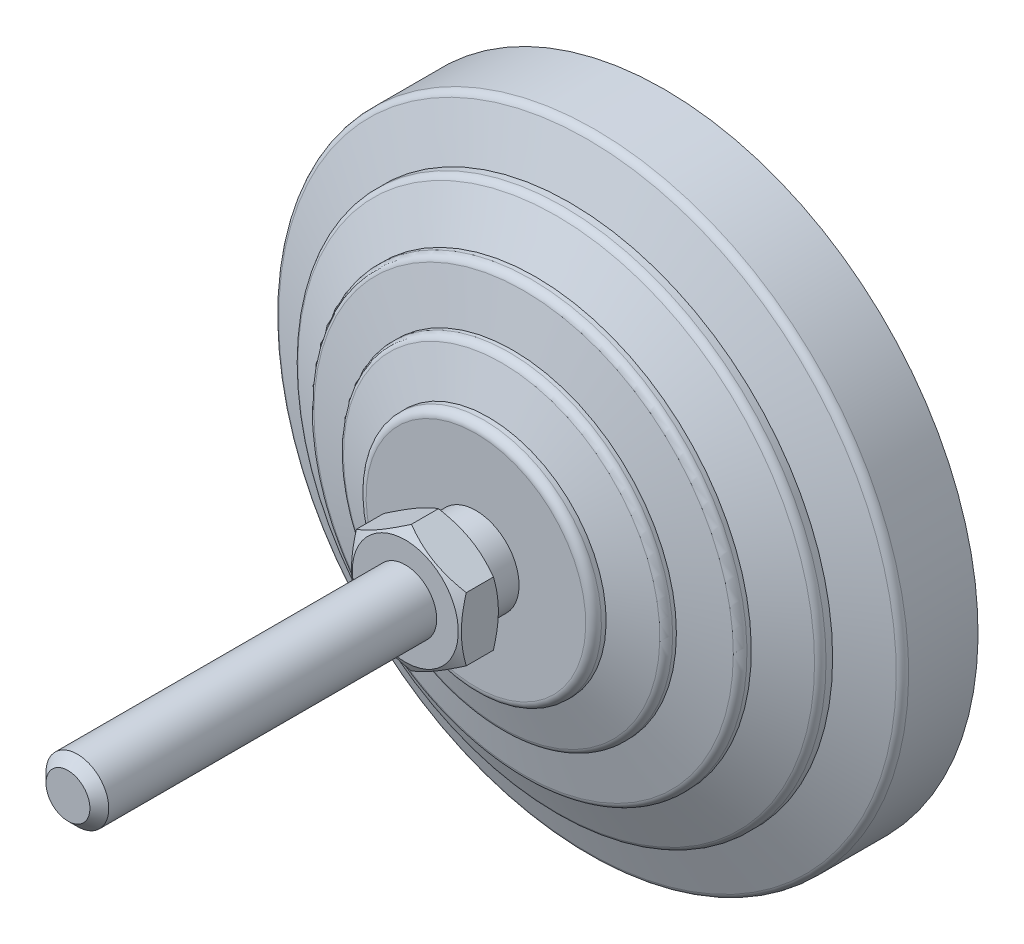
ISO-10303-21;
HEADER;
FILE_DESCRIPTION(('STEP AP214'),'2;1');
FILE_NAME('part.step','',(''),(''),'','','');
FILE_SCHEMA(('AUTOMOTIVE_DESIGN { 1 0 10303 214 1 1 1 1 }'));
ENDSEC;
DATA;
#1=APPLICATION_CONTEXT('core data for automotive mechanical design processes');
#2=APPLICATION_PROTOCOL_DEFINITION('international standard','automotive_design',2000,#1);
#3=PRODUCT_CONTEXT('',#1,'mechanical');
#4=PRODUCT('Part','Part','',(#3));
#5=PRODUCT_RELATED_PRODUCT_CATEGORY('part','',(#4));
#6=PRODUCT_DEFINITION_FORMATION('','',#4);
#7=PRODUCT_DEFINITION_CONTEXT('part definition',#1,'design');
#8=PRODUCT_DEFINITION('design','',#6,#7);
#9=PRODUCT_DEFINITION_SHAPE('','',#8);
#10=(LENGTH_UNIT() NAMED_UNIT(*) SI_UNIT(.MILLI.,.METRE.));
#11=(NAMED_UNIT(*) PLANE_ANGLE_UNIT() SI_UNIT($,.RADIAN.));
#12=(NAMED_UNIT(*) SI_UNIT($,.STERADIAN.) SOLID_ANGLE_UNIT());
#13=UNCERTAINTY_MEASURE_WITH_UNIT(LENGTH_MEASURE(1.E-05),#10,'distance_accuracy_value','');
#14=(GEOMETRIC_REPRESENTATION_CONTEXT(3) GLOBAL_UNCERTAINTY_ASSIGNED_CONTEXT((#13)) GLOBAL_UNIT_ASSIGNED_CONTEXT((#10,
#11,#12)) REPRESENTATION_CONTEXT('',''));
#15=CARTESIAN_POINT('',(0.,0.,0.));
#16=DIRECTION('',(0.,0.,1.));
#17=DIRECTION('',(1.,0.,0.));
#18=AXIS2_PLACEMENT_3D('',#15,#16,#17);
#19=CARTESIAN_POINT('',(-5.49999999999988,0.,28.));
#20=DIRECTION('',(0.,0.,1.));
#21=DIRECTION('',(0.,-1.,0.));
#22=AXIS2_PLACEMENT_3D('',#19,#20,#21);
#23=PLANE('',#22);
#24=CARTESIAN_POINT('',(0.,0.,28.));
#25=DIRECTION('',(0.,0.,-1.));
#26=DIRECTION('',(-1.,0.,0.));
#27=AXIS2_PLACEMENT_3D('',#24,#25,#26);
#28=CIRCLE('',#27,6.75);
#29=CARTESIAN_POINT('',(-6.75,0.,28.));
#30=VERTEX_POINT('',#29);
#31=EDGE_CURVE('E544',#30,#30,#28,.T.);
#32=ORIENTED_EDGE('',*,*,#31,.T.);
#33=EDGE_LOOP('',(#32));
#34=FACE_BOUND('',#33,.T.);
#35=CARTESIAN_POINT('',(0.,0.,28.));
#36=DIRECTION('',(0.,0.,-1.));
#37=DIRECTION('',(0.,1.,0.));
#38=AXIS2_PLACEMENT_3D('',#35,#36,#37);
#39=CIRCLE('',#38,5.49999999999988);
#40=CARTESIAN_POINT('',(0.,5.49999999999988,28.));
#41=VERTEX_POINT('',#40);
#42=EDGE_CURVE('E144',#41,#41,#39,.T.);
#43=ORIENTED_EDGE('',*,*,#42,.F.);
#44=EDGE_LOOP('',(#43));
#45=FACE_BOUND('',#44,.T.);
#46=ADVANCED_FACE('F14',(#34,#45),#23,.F.);
#47=CARTESIAN_POINT('',(0.,0.,0.));
#48=DIRECTION('',(0.,0.,-1.));
#49=DIRECTION('',(0.,1.,0.));
#50=AXIS2_PLACEMENT_3D('',#47,#48,#49);
#51=CYLINDRICAL_SURFACE('',#50,5.49999999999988);
#52=CARTESIAN_POINT('',(0.,0.,24.));
#53=DIRECTION('',(0.,0.,-1.));
#54=DIRECTION('',(0.,1.,0.));
#55=AXIS2_PLACEMENT_3D('',#52,#53,#54);
#56=CIRCLE('',#55,5.49999999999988);
#57=CARTESIAN_POINT('',(0.,5.49999999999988,24.));
#58=VERTEX_POINT('',#57);
#59=EDGE_CURVE('E141',#58,#58,#56,.T.);
#60=ORIENTED_EDGE('',*,*,#59,.F.);
#61=EDGE_LOOP('',(#60));
#62=FACE_BOUND('',#61,.T.);
#63=ORIENTED_EDGE('',*,*,#42,.T.);
#64=EDGE_LOOP('',(#63));
#65=FACE_BOUND('',#64,.T.);
#66=ADVANCED_FACE('F168',(#62,#65),#51,.T.);
#67=CARTESIAN_POINT('',(-5.49999999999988,0.,24.));
#68=DIRECTION('',(0.,0.,-1.));
#69=DIRECTION('',(0.,1.,0.));
#70=AXIS2_PLACEMENT_3D('',#67,#68,#69);
#71=PLANE('',#70);
#72=CARTESIAN_POINT('',(0.,0.,24.));
#73=DIRECTION('',(0.,0.,-1.));
#74=DIRECTION('',(0.,1.,0.));
#75=AXIS2_PLACEMENT_3D('',#72,#73,#74);
#76=CIRCLE('',#75,14.);
#77=CARTESIAN_POINT('',(0.,14.,24.));
#78=VERTEX_POINT('',#77);
#79=EDGE_CURVE('E138',#78,#78,#76,.T.);
#80=ORIENTED_EDGE('',*,*,#79,.F.);
#81=EDGE_LOOP('',(#80));
#82=FACE_BOUND('',#81,.T.);
#83=ORIENTED_EDGE('',*,*,#59,.T.);
#84=EDGE_LOOP('',(#83));
#85=FACE_BOUND('',#84,.T.);
#86=ADVANCED_FACE('F175',(#82,#85),#71,.F.);
#87=CARTESIAN_POINT('',(0.,0.,23.));
#88=DIRECTION('',(0.,0.,-1.));
#89=DIRECTION('',(0.,1.,0.));
#90=AXIS2_PLACEMENT_3D('',#87,#88,#89);
#91=TOROIDAL_SURFACE('',#90,14.,1.);
#92=CARTESIAN_POINT('',(0.,0.,23.));
#93=DIRECTION('',(0.,0.,-1.));
#94=DIRECTION('',(0.,1.,0.));
#95=AXIS2_PLACEMENT_3D('',#92,#93,#94);
#96=CIRCLE('',#95,15.);
#97=CARTESIAN_POINT('',(0.,15.,23.));
#98=VERTEX_POINT('',#97);
#99=EDGE_CURVE('E135',#98,#98,#96,.T.);
#100=ORIENTED_EDGE('',*,*,#99,.F.);
#101=EDGE_LOOP('',(#100));
#102=FACE_BOUND('',#101,.T.);
#103=ORIENTED_EDGE('',*,*,#79,.T.);
#104=EDGE_LOOP('',(#103));
#105=FACE_BOUND('',#104,.T.);
#106=ADVANCED_FACE('F407',(#102,#105),#91,.T.);
#107=CARTESIAN_POINT('',(0.,0.,0.));
#108=DIRECTION('',(0.,0.,-1.));
#109=DIRECTION('',(0.,1.,0.));
#110=AXIS2_PLACEMENT_3D('',#107,#108,#109);
#111=CYLINDRICAL_SURFACE('',#110,15.);
#112=CARTESIAN_POINT('',(0.,0.,22.4025287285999));
#113=DIRECTION('',(0.,0.,-1.));
#114=DIRECTION('',(0.,1.,0.));
#115=AXIS2_PLACEMENT_3D('',#112,#113,#114);
#116=CIRCLE('',#115,15.);
#117=CARTESIAN_POINT('',(0.,15.,22.4025287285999));
#118=VERTEX_POINT('',#117);
#119=EDGE_CURVE('E132',#118,#118,#116,.T.);
#120=ORIENTED_EDGE('',*,*,#119,.F.);
#121=EDGE_LOOP('',(#120));
#122=FACE_BOUND('',#121,.T.);
#123=ORIENTED_EDGE('',*,*,#99,.T.);
#124=EDGE_LOOP('',(#123));
#125=FACE_BOUND('',#124,.T.);
#126=ADVANCED_FACE('F397',(#122,#125),#111,.T.);
#127=CARTESIAN_POINT('',(0.,0.,22.4025287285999));
#128=DIRECTION('',(0.,0.,-1.));
#129=DIRECTION('',(0.,1.,0.));
#130=AXIS2_PLACEMENT_3D('',#127,#128,#129);
#131=CONICAL_SURFACE('',#130,15.,1.25589726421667);
#132=CARTESIAN_POINT('',(0.,0.,20.7216684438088));
#133=DIRECTION('',(0.,0.,-1.));
#134=DIRECTION('',(0.,1.,0.));
#135=AXIS2_PLACEMENT_3D('',#132,#133,#134);
#136=CIRCLE('',#135,20.16016354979);
#137=CARTESIAN_POINT('',(0.,20.16016354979,20.7216684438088));
#138=VERTEX_POINT('',#137);
#139=EDGE_CURVE('E129',#138,#138,#136,.T.);
#140=ORIENTED_EDGE('',*,*,#139,.F.);
#141=EDGE_LOOP('',(#140));
#142=FACE_BOUND('',#141,.T.);
#143=ORIENTED_EDGE('',*,*,#119,.T.);
#144=EDGE_LOOP('',(#143));
#145=FACE_BOUND('',#144,.T.);
#146=ADVANCED_FACE('F387',(#142,#145),#131,.T.);
#147=CARTESIAN_POINT('',(0.,0.,19.7708407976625));
#148=DIRECTION('',(0.,0.,-1.));
#149=DIRECTION('',(0.,1.,0.));
#150=AXIS2_PLACEMENT_3D('',#147,#148,#149);
#151=TOROIDAL_SURFACE('',#150,19.8504430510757,1.);
#152=CARTESIAN_POINT('',(0.,0.,19.7708407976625));
#153=DIRECTION('',(0.,0.,-1.));
#154=DIRECTION('',(0.,1.,0.));
#155=AXIS2_PLACEMENT_3D('',#152,#153,#154);
#156=CIRCLE('',#155,20.8504430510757);
#157=CARTESIAN_POINT('',(0.,20.8504430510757,19.7708407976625));
#158=VERTEX_POINT('',#157);
#159=EDGE_CURVE('E126',#158,#158,#156,.T.);
#160=ORIENTED_EDGE('',*,*,#159,.F.);
#161=EDGE_LOOP('',(#160));
#162=FACE_BOUND('',#161,.T.);
#163=ORIENTED_EDGE('',*,*,#139,.T.);
#164=EDGE_LOOP('',(#163));
#165=FACE_BOUND('',#164,.T.);
#166=ADVANCED_FACE('F377',(#162,#165),#151,.T.);
#167=CARTESIAN_POINT('',(0.,0.,0.));
#168=DIRECTION('',(0.,0.,-1.));
#169=DIRECTION('',(0.,1.,0.));
#170=AXIS2_PLACEMENT_3D('',#167,#168,#169);
#171=CYLINDRICAL_SURFACE('',#170,20.8504430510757);
#172=CARTESIAN_POINT('',(0.,0.,19.2987385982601));
#173=DIRECTION('',(0.,0.,-1.));
#174=DIRECTION('',(0.,1.,0.));
#175=AXIS2_PLACEMENT_3D('',#172,#173,#174);
#176=CIRCLE('',#175,20.8504430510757);
#177=CARTESIAN_POINT('',(0.,20.8504430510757,19.2987385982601));
#178=VERTEX_POINT('',#177);
#179=EDGE_CURVE('E123',#178,#178,#176,.T.);
#180=ORIENTED_EDGE('',*,*,#179,.F.);
#181=EDGE_LOOP('',(#180));
#182=FACE_BOUND('',#181,.T.);
#183=ORIENTED_EDGE('',*,*,#159,.T.);
#184=EDGE_LOOP('',(#183));
#185=FACE_BOUND('',#184,.T.);
#186=ADVANCED_FACE('F367',(#182,#185),#171,.T.);
#187=CARTESIAN_POINT('',(0.,0.,19.2987385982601));
#188=DIRECTION('',(0.,0.,-1.));
#189=DIRECTION('',(0.,1.,0.));
#190=AXIS2_PLACEMENT_3D('',#187,#188,#189);
#191=CONICAL_SURFACE('',#190,20.8504430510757,1.34067144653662);
#192=CARTESIAN_POINT('',(0.,0.,17.9217501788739));
#193=DIRECTION('',(0.,0.,-1.));
#194=DIRECTION('',(0.,1.,0.));
#195=AXIS2_PLACEMENT_3D('',#192,#193,#194);
#196=CIRCLE('',#195,26.7280991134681);
#197=CARTESIAN_POINT('',(0.,26.7280991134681,17.9217501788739));
#198=VERTEX_POINT('',#197);
#199=EDGE_CURVE('E120',#198,#198,#196,.T.);
#200=ORIENTED_EDGE('',*,*,#199,.F.);
#201=EDGE_LOOP('',(#200));
#202=FACE_BOUND('',#201,.T.);
#203=ORIENTED_EDGE('',*,*,#179,.T.);
#204=EDGE_LOOP('',(#203));
#205=FACE_BOUND('',#204,.T.);
#206=ADVANCED_FACE('F357',(#202,#205),#191,.T.);
#207=CARTESIAN_POINT('',(0.,0.,16.9481122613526));
#208=DIRECTION('',(0.,0.,-1.));
#209=DIRECTION('',(0.,1.,0.));
#210=AXIS2_PLACEMENT_3D('',#207,#208,#209);
#211=TOROIDAL_SURFACE('',#210,26.5,1.);
#212=CARTESIAN_POINT('',(0.,0.,16.9481122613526));
#213=DIRECTION('',(0.,0.,-1.));
#214=DIRECTION('',(0.,1.,0.));
#215=AXIS2_PLACEMENT_3D('',#212,#213,#214);
#216=CIRCLE('',#215,27.5);
#217=CARTESIAN_POINT('',(0.,27.5,16.9481122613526));
#218=VERTEX_POINT('',#217);
#219=EDGE_CURVE('E117',#218,#218,#216,.T.);
#220=ORIENTED_EDGE('',*,*,#219,.F.);
#221=EDGE_LOOP('',(#220));
#222=FACE_BOUND('',#221,.T.);
#223=ORIENTED_EDGE('',*,*,#199,.T.);
#224=EDGE_LOOP('',(#223));
#225=FACE_BOUND('',#224,.T.);
#226=ADVANCED_FACE('F347',(#222,#225),#211,.T.);
#227=CARTESIAN_POINT('',(0.,0.,0.));
#228=DIRECTION('',(0.,0.,-1.));
#229=DIRECTION('',(0.,1.,0.));
#230=AXIS2_PLACEMENT_3D('',#227,#228,#229);
#231=CYLINDRICAL_SURFACE('',#230,27.5);
#232=CARTESIAN_POINT('',(0.,0.,16.4025287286));
#233=DIRECTION('',(0.,0.,-1.));
#234=DIRECTION('',(0.,1.,0.));
#235=AXIS2_PLACEMENT_3D('',#232,#233,#234);
#236=CIRCLE('',#235,27.5);
#237=CARTESIAN_POINT('',(0.,27.5,16.4025287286));
#238=VERTEX_POINT('',#237);
#239=EDGE_CURVE('E114',#238,#238,#236,.T.);
#240=ORIENTED_EDGE('',*,*,#239,.F.);
#241=EDGE_LOOP('',(#240));
#242=FACE_BOUND('',#241,.T.);
#243=ORIENTED_EDGE('',*,*,#219,.T.);
#244=EDGE_LOOP('',(#243));
#245=FACE_BOUND('',#244,.T.);
#246=ADVANCED_FACE('F337',(#242,#245),#231,.T.);
#247=CARTESIAN_POINT('',(0.,0.,16.4025287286));
#248=DIRECTION('',(0.,0.,-1.));
#249=DIRECTION('',(0.,1.,0.));
#250=AXIS2_PLACEMENT_3D('',#247,#248,#249);
#251=CONICAL_SURFACE('',#250,27.5,1.12022914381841);
#252=CARTESIAN_POINT('',(0.,0.,13.7730910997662));
#253=DIRECTION('',(0.,0.,-1.));
#254=DIRECTION('',(0.,1.,0.));
#255=AXIS2_PLACEMENT_3D('',#252,#253,#254);
#256=CIRCLE('',#255,32.9354761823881);
#257=CARTESIAN_POINT('',(0.,32.9354761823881,13.7730910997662));
#258=VERTEX_POINT('',#257);
#259=EDGE_CURVE('E111',#258,#258,#256,.T.);
#260=ORIENTED_EDGE('',*,*,#259,.F.);
#261=EDGE_LOOP('',(#260));
#262=FACE_BOUND('',#261,.T.);
#263=ORIENTED_EDGE('',*,*,#239,.T.);
#264=EDGE_LOOP('',(#263));
#265=FACE_BOUND('',#264,.T.);
#266=ADVANCED_FACE('F327',(#262,#265),#251,.T.);
#267=CARTESIAN_POINT('',(0.,0.,12.872890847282));
#268=DIRECTION('',(0.,0.,-1.));
#269=DIRECTION('',(0.,1.,0.));
#270=AXIS2_PLACEMENT_3D('',#267,#268,#269);
#271=TOROIDAL_SURFACE('',#270,32.5,1.);
#272=CARTESIAN_POINT('',(0.,0.,12.872890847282));
#273=DIRECTION('',(0.,0.,-1.));
#274=DIRECTION('',(0.,1.,0.));
#275=AXIS2_PLACEMENT_3D('',#272,#273,#274);
#276=CIRCLE('',#275,33.5);
#277=CARTESIAN_POINT('',(0.,33.5,12.872890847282));
#278=VERTEX_POINT('',#277);
#279=EDGE_CURVE('E108',#278,#278,#276,.T.);
#280=ORIENTED_EDGE('',*,*,#279,.F.);
#281=EDGE_LOOP('',(#280));
#282=FACE_BOUND('',#281,.T.);
#283=ORIENTED_EDGE('',*,*,#259,.T.);
#284=EDGE_LOOP('',(#283));
#285=FACE_BOUND('',#284,.T.);
#286=ADVANCED_FACE('F317',(#282,#285),#271,.T.);
#287=CARTESIAN_POINT('',(0.,0.,0.));
#288=DIRECTION('',(0.,0.,-1.));
#289=DIRECTION('',(0.,1.,0.));
#290=AXIS2_PLACEMENT_3D('',#287,#288,#289);
#291=CYLINDRICAL_SURFACE('',#290,33.5);
#292=CARTESIAN_POINT('',(0.,0.,12.0315037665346));
#293=DIRECTION('',(0.,0.,-1.));
#294=DIRECTION('',(0.,1.,0.));
#295=AXIS2_PLACEMENT_3D('',#292,#293,#294);
#296=CIRCLE('',#295,33.5);
#297=CARTESIAN_POINT('',(0.,33.5,12.0315037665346));
#298=VERTEX_POINT('',#297);
#299=EDGE_CURVE('E105',#298,#298,#296,.T.);
#300=ORIENTED_EDGE('',*,*,#299,.F.);
#301=EDGE_LOOP('',(#300));
#302=FACE_BOUND('',#301,.T.);
#303=ORIENTED_EDGE('',*,*,#279,.T.);
#304=EDGE_LOOP('',(#303));
#305=FACE_BOUND('',#304,.T.);
#306=ADVANCED_FACE('F307',(#302,#305),#291,.T.);
#307=CARTESIAN_POINT('',(0.,0.,12.0315037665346));
#308=DIRECTION('',(0.,0.,-1.));
#309=DIRECTION('',(0.,1.,0.));
#310=AXIS2_PLACEMENT_3D('',#307,#308,#309);
#311=CONICAL_SURFACE('',#310,33.5,1.20362249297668);
#312=CARTESIAN_POINT('',(0.,0.,9.77805027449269));
#313=DIRECTION('',(0.,0.,-1.));
#314=DIRECTION('',(0.,1.,0.));
#315=AXIS2_PLACEMENT_3D('',#312,#313,#314);
#316=CIRCLE('',#315,39.358979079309);
#317=CARTESIAN_POINT('',(0.,39.358979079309,9.77805027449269));
#318=VERTEX_POINT('',#317);
#319=EDGE_CURVE('E102',#318,#318,#316,.T.);
#320=ORIENTED_EDGE('',*,*,#319,.F.);
#321=EDGE_LOOP('',(#320));
#322=FACE_BOUND('',#321,.T.);
#323=ORIENTED_EDGE('',*,*,#299,.T.);
#324=EDGE_LOOP('',(#323));
#325=FACE_BOUND('',#324,.T.);
#326=ADVANCED_FACE('F297',(#322,#325),#311,.T.);
#327=CARTESIAN_POINT('',(0.,0.,8.84470466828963));
#328=DIRECTION('',(0.,0.,-1.));
#329=DIRECTION('',(0.,1.,0.));
#330=AXIS2_PLACEMENT_3D('',#327,#328,#329);
#331=TOROIDAL_SURFACE('',#330,39.,1.);
#332=CARTESIAN_POINT('',(0.,0.,8.84470466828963));
#333=DIRECTION('',(0.,0.,-1.));
#334=DIRECTION('',(0.,1.,0.));
#335=AXIS2_PLACEMENT_3D('',#332,#333,#334);
#336=CIRCLE('',#335,40.);
#337=CARTESIAN_POINT('',(0.,40.,8.84470466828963));
#338=VERTEX_POINT('',#337);
#339=EDGE_CURVE('E99',#338,#338,#336,.T.);
#340=ORIENTED_EDGE('',*,*,#339,.F.);
#341=EDGE_LOOP('',(#340));
#342=FACE_BOUND('',#341,.T.);
#343=ORIENTED_EDGE('',*,*,#319,.T.);
#344=EDGE_LOOP('',(#343));
#345=FACE_BOUND('',#344,.T.);
#346=ADVANCED_FACE('F287',(#342,#345),#331,.T.);
#347=CARTESIAN_POINT('',(0.,0.,0.));
#348=DIRECTION('',(0.,0.,-1.));
#349=DIRECTION('',(0.,1.,0.));
#350=AXIS2_PLACEMENT_3D('',#347,#348,#349);
#351=CYLINDRICAL_SURFACE('',#350,40.);
#352=CARTESIAN_POINT('',(0.,0.,0.));
#353=DIRECTION('',(0.,0.,-1.));
#354=DIRECTION('',(0.,1.,0.));
#355=AXIS2_PLACEMENT_3D('',#352,#353,#354);
#356=CIRCLE('',#355,40.);
#357=CARTESIAN_POINT('',(0.,40.,0.));
#358=VERTEX_POINT('',#357);
#359=EDGE_CURVE('E96',#358,#358,#356,.T.);
#360=ORIENTED_EDGE('',*,*,#359,.F.);
#361=EDGE_LOOP('',(#360));
#362=FACE_BOUND('',#361,.T.);
#363=ORIENTED_EDGE('',*,*,#339,.T.);
#364=EDGE_LOOP('',(#363));
#365=FACE_BOUND('',#364,.T.);
#366=ADVANCED_FACE('F276',(#362,#365),#351,.T.);
#367=CARTESIAN_POINT('',(0.,0.,0.));
#368=DIRECTION('',(0.,0.,1.));
#369=DIRECTION('',(0.,-1.,0.));
#370=AXIS2_PLACEMENT_3D('',#367,#368,#369);
#371=PLANE('',#370);
#372=ORIENTED_EDGE('',*,*,#359,.T.);
#373=EDGE_LOOP('',(#372));
#374=FACE_BOUND('',#373,.T.);
#375=ADVANCED_FACE('F166',(#374),#371,.F.);
#376=CARTESIAN_POINT('',(0.,0.,30.199754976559));
#377=DIRECTION('',(0.,0.,1.));
#378=DIRECTION('',(1.,0.,0.));
#379=AXIS2_PLACEMENT_3D('',#376,#377,#378);
#380=CONICAL_SURFACE('',#379,10.5600873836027,1.0471975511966);
#381=CARTESIAN_POINT('',(0.000200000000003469,-8.0830192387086,28.7696190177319));
#382=CARTESIAN_POINT('',(-0.153667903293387,-7.99418356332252,28.7183374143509));
#383=CARTESIAN_POINT('',(-0.308109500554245,-7.90501666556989,28.669383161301));
#384=CARTESIAN_POINT('',(-0.61824692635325,-7.72595873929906,28.5767703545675));
#385=CARTESIAN_POINT('',(-0.773943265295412,-7.63606741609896,28.5331140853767));
#386=CARTESIAN_POINT('',(-1.24352516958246,-7.36495417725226,28.4109491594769));
#387=CARTESIAN_POINT('',(-1.5592643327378,-7.18266208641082,28.3414631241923));
#388=CARTESIAN_POINT('',(-2.03176224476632,-6.90986528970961,28.2599825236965));
#389=CARTESIAN_POINT('',(-2.18710922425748,-6.82017566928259,28.2367710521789));
#390=CARTESIAN_POINT('',(-2.49850511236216,-6.64039116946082,28.1978487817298));
#391=CARTESIAN_POINT('',(-2.6545539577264,-6.55029632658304,28.1821373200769));
#392=CARTESIAN_POINT('',(-2.96692267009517,-6.36995016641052,28.1586154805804));
#393=CARTESIAN_POINT('',(-3.12324202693,-6.27969914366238,28.1507961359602));
#394=CARTESIAN_POINT('',(-3.43601650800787,-6.09911871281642,28.1432178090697));
#395=CARTESIAN_POINT('',(-3.59247162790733,-6.00878930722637,28.1434585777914));
#396=CARTESIAN_POINT('',(-4.02110687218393,-5.76131663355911,28.155197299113));
#397=CARTESIAN_POINT('',(-4.2931466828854,-5.60425437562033,28.1749033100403));
#398=CARTESIAN_POINT('',(-4.8354194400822,-5.29117305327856,28.2373910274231));
#399=CARTESIAN_POINT('',(-5.10565047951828,-5.13515508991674,28.2801940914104));
#400=CARTESIAN_POINT('',(-5.64901454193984,-4.82144370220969,28.3871892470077));
#401=CARTESIAN_POINT('',(-5.92207900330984,-4.6637898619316,28.451834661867));
#402=CARTESIAN_POINT('',(-6.46413578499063,-4.35083323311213,28.5985536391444));
#403=CARTESIAN_POINT('',(-6.73313504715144,-4.19552643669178,28.680592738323));
#404=CARTESIAN_POINT('',(-7.0002,-4.04133641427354,28.7696190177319));
#405=B_SPLINE_CURVE_WITH_KNOTS('',3,(#381,#382,#383,#384,#385,#386,#387,#388,#389,#390,#391,
#392,#393,#394,#395,#396,#397,#398,#399,#400,#401,#402,#403,#404),.UNSPECIFIED.,.F.,.F.,(4,2,2,
2,2,2,2,2,2,2,2,4),(0.,0.554727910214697,1.10969417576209,2.2219327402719,2.76443041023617,
3.30688013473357,3.8487128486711,4.39052882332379,5.33376515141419,6.27787517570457,
7.24292418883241,8.20607866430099),.UNSPECIFIED.);
#406=CARTESIAN_POINT('',(0.,-8.08290376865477,28.7695523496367));
#407=VERTEX_POINT('',#406);
#408=CARTESIAN_POINT('',(-7.,-4.04145188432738,28.7695523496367));
#409=VERTEX_POINT('',#408);
#410=EDGE_CURVE('E73',#407,#409,#405,.T.);
#411=ORIENTED_EDGE('',*,*,#410,.T.);
#412=CARTESIAN_POINT('',(-7.,-10.8979078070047,31.5809512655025));
#413=CARTESIAN_POINT('',(-7.,-10.5918156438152,31.4323004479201));
#414=CARTESIAN_POINT('',(-7.,-10.2850253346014,31.2850628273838));
#415=CARTESIAN_POINT('',(-7.,-9.6696772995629,30.9942079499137));
#416=CARTESIAN_POINT('',(-7.,-9.3611193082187,30.8505912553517));
#417=CARTESIAN_POINT('',(-7.,-8.74029512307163,30.5670586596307));
#418=CARTESIAN_POINT('',(-7.,-8.42801791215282,30.4271667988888));
#419=CARTESIAN_POINT('',(-7.,-7.80099448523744,30.1530519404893));
#420=CARTESIAN_POINT('',(-7.,-7.48624838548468,30.0188286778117));
#421=CARTESIAN_POINT('',(-7.,-6.84346728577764,29.7532831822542));
#422=CARTESIAN_POINT('',(-7.,-6.51533367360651,29.6221983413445));
#423=CARTESIAN_POINT('',(-7.,-5.85524387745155,29.3698480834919));
#424=CARTESIAN_POINT('',(-7.,-5.52328727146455,29.2485837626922));
#425=CARTESIAN_POINT('',(-7.,-4.8556271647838,29.0190274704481));
#426=CARTESIAN_POINT('',(-7.,-4.51993266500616,28.9107095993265));
#427=CARTESIAN_POINT('',(-7.,-3.84374026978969,28.7104928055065));
#428=CARTESIAN_POINT('',(-7.,-3.50324391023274,28.6185887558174));
#429=CARTESIAN_POINT('',(-7.,-2.8190959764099,28.4560791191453));
#430=CARTESIAN_POINT('',(-7.,-2.47547296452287,28.3853565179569));
#431=CARTESIAN_POINT('',(-7.,-1.95687545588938,28.2981988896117));
#432=CARTESIAN_POINT('',(-7.,-1.78346984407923,28.2722995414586));
#433=CARTESIAN_POINT('',(-7.,-1.43578326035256,28.2273167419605));
#434=CARTESIAN_POINT('',(-7.,-1.2615023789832,28.2082325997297));
#435=CARTESIAN_POINT('',(-7.,-0.9145929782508,28.1775018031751));
#436=CARTESIAN_POINT('',(-7.,-0.741972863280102,28.165760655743));
#437=CARTESIAN_POINT('',(-7.,-0.396390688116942,28.1495908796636));
#438=CARTESIAN_POINT('',(-7.,-0.223428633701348,28.1451621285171));
#439=CARTESIAN_POINT('',(-7.,0.122527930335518,28.1437229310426));
#440=CARTESIAN_POINT('',(-7.,0.295522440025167,28.1467125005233));
#441=CARTESIAN_POINT('',(-7.,0.641230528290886,28.1600362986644));
#442=CARTESIAN_POINT('',(-7.,0.813944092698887,28.1703708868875));
#443=CARTESIAN_POINT('',(-7.,1.22775147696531,28.2037110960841));
#444=CARTESIAN_POINT('',(-7.,1.46857614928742,28.2301307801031));
#445=CARTESIAN_POINT('',(-7.,1.94845438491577,28.2958188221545));
#446=CARTESIAN_POINT('',(-7.,2.18750770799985,28.3350888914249));
#447=CARTESIAN_POINT('',(-7.,2.90172792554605,28.4700937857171));
#448=CARTESIAN_POINT('',(-7.,3.37369298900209,28.5829993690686));
#449=CARTESIAN_POINT('',(-7.,4.07947048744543,28.7790028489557));
#450=CARTESIAN_POINT('',(-7.,4.31693791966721,28.849698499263));
#451=CARTESIAN_POINT('',(-7.,4.78956681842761,28.9984866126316));
#452=CARTESIAN_POINT('',(-7.,5.02472826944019,29.0765791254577));
#453=CARTESIAN_POINT('',(-7.,5.49281820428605,29.238903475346));
#454=CARTESIAN_POINT('',(-7.,5.72574738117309,29.3231333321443));
#455=CARTESIAN_POINT('',(-7.,6.18967208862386,29.4967359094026));
#456=CARTESIAN_POINT('',(-7.,6.42066764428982,29.5861085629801));
#457=CARTESIAN_POINT('',(-7.,6.97537470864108,29.8066971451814));
#458=CARTESIAN_POINT('',(-7.,7.29824058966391,29.9400359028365));
#459=CARTESIAN_POINT('',(-7.,7.94114518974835,30.2133834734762));
#460=CARTESIAN_POINT('',(-7.,8.26118371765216,30.3533927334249));
#461=CARTESIAN_POINT('',(-7.,8.89897582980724,30.6387134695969));
#462=CARTESIAN_POINT('',(-7.,9.21672883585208,30.7840262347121));
#463=CARTESIAN_POINT('',(-7.,9.85026324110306,31.0788578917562));
#464=CARTESIAN_POINT('',(-7.,10.1660446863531,31.228376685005));
#465=CARTESIAN_POINT('',(-7.,10.7963385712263,31.5309911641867));
#466=CARTESIAN_POINT('',(-7.,11.1108491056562,31.6840908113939));
#467=CARTESIAN_POINT('',(-7.,11.7384977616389,31.9930805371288));
#468=CARTESIAN_POINT('',(-7.,12.0516358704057,32.1489706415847));
#469=CARTESIAN_POINT('',(-7.,12.9892359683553,32.6200238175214));
#470=CARTESIAN_POINT('',(-7.,13.6119757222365,32.9386142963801));
#471=CARTESIAN_POINT('',(-7.,14.800236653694,33.5542487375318));
#472=CARTESIAN_POINT('',(-7.,15.3660334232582,33.850763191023));
#473=CARTESIAN_POINT('',(-7.,16.4955394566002,34.4477915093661));
#474=CARTESIAN_POINT('',(-7.,17.0592486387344,34.7483055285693));
#475=CARTESIAN_POINT('',(-7.,18.1835622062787,35.351572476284));
#476=CARTESIAN_POINT('',(-7.,18.744170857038,35.6543174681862));
#477=CARTESIAN_POINT('',(-7.,19.8640592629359,36.262178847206));
#478=CARTESIAN_POINT('',(-7.,20.4233390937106,36.5672950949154));
#479=CARTESIAN_POINT('',(-7.,20.9821329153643,36.8732929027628));
#480=B_SPLINE_CURVE_WITH_KNOTS('',3,(#412,#413,#414,#415,#416,#417,#418,#419,#420,#421,#422,
#423,#424,#425,#426,#427,#428,#429,#430,#431,#432,#433,#434,#435,#436,#437,#438,#439,#440,#441,
#442,#443,#444,#445,#446,#447,#448,#449,#450,#451,#452,#453,#454,#455,#456,#457,#458,#459,#460,
#461,#462,#463,#464,#465,#466,#467,#468,#469,#470,#471,#472,#473,#474,#475,#476,#477,#478,#479),
.UNSPECIFIED.,.F.,.F.,(4,2,2,2,2,2,2,2,2,2,2,2,2,2,2,2,2,2,2,2,2,2,2,2,2,2,2,2,2,2,2,2,2,4),(0.,
1.02084784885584,2.04185328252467,3.06834651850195,4.09479171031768,5.1547141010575,
6.21475463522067,7.27263772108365,8.3301897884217,9.38178695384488,9.90766133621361,
10.4334823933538,10.9523896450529,11.4712882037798,11.9901878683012,12.509112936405,
13.2355119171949,13.9620076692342,15.4157851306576,16.1590242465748,16.9022683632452,
17.6452737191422,18.3882694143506,19.4361145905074,20.4840300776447,21.5322019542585,
22.5803492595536,23.6297167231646,24.6790939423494,26.7775417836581,28.6938810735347,
30.6102945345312,32.5216830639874,34.4329600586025),.UNSPECIFIED.);
#481=CARTESIAN_POINT('',(-7.,4.04145188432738,28.7695523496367));
#482=VERTEX_POINT('',#481);
#483=EDGE_CURVE('E81',#409,#482,#480,.T.);
#484=ORIENTED_EDGE('',*,*,#483,.T.);
#485=CARTESIAN_POINT('',(-7.0002,4.04133641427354,28.7696190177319));
#486=CARTESIAN_POINT('',(-6.84633209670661,4.13017208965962,28.7183374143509));
#487=CARTESIAN_POINT('',(-6.69189049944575,4.21933898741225,28.669383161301));
#488=CARTESIAN_POINT('',(-6.38175307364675,4.39839691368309,28.5767703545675));
#489=CARTESIAN_POINT('',(-6.22605673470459,4.48828823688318,28.5331140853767));
#490=CARTESIAN_POINT('',(-5.75647483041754,4.75940147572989,28.4109491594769));
#491=CARTESIAN_POINT('',(-5.44073566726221,4.94169356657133,28.3414631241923));
#492=CARTESIAN_POINT('',(-4.96823775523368,5.21449036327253,28.2599825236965));
#493=CARTESIAN_POINT('',(-4.81289077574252,5.30417998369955,28.2367710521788));
#494=CARTESIAN_POINT('',(-4.50149488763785,5.48396448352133,28.1978487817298));
#495=CARTESIAN_POINT('',(-4.3454460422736,5.5740593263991,28.1821373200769));
#496=CARTESIAN_POINT('',(-4.03307732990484,5.75440548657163,28.1586154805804));
#497=CARTESIAN_POINT('',(-3.87675797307,5.84465650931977,28.1507961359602));
#498=CARTESIAN_POINT('',(-3.56398349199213,6.02523694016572,28.1432178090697));
#499=CARTESIAN_POINT('',(-3.40752837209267,6.11556634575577,28.1434585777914));
#500=CARTESIAN_POINT('',(-2.97889312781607,6.36303901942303,28.155197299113));
#501=CARTESIAN_POINT('',(-2.7068533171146,6.52010127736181,28.1749033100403));
#502=CARTESIAN_POINT('',(-2.1645805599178,6.83318259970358,28.2373910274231));
#503=CARTESIAN_POINT('',(-1.89434952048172,6.9892005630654,28.2801940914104));
#504=CARTESIAN_POINT('',(-1.35098545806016,7.30291195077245,28.3871892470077));
#505=CARTESIAN_POINT('',(-1.07792099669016,7.46056579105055,28.451834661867));
#506=CARTESIAN_POINT('',(-0.535864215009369,7.77352241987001,28.5985536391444));
#507=CARTESIAN_POINT('',(-0.266864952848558,7.92882921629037,28.6805927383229));
#508=CARTESIAN_POINT('',(0.000199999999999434,8.0830192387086,28.7696190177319));
#509=B_SPLINE_CURVE_WITH_KNOTS('',3,(#485,#486,#487,#488,#489,#490,#491,#492,#493,#494,#495,
#496,#497,#498,#499,#500,#501,#502,#503,#504,#505,#506,#507,#508),.UNSPECIFIED.,.F.,.F.,(4,2,2,
2,2,2,2,2,2,2,2,4),(0.,0.554727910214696,1.10969417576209,2.2219327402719,2.76443041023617,
3.30688013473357,3.8487128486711,4.39052882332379,5.33376515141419,6.27787517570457,
7.24292418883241,8.20607866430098),.UNSPECIFIED.);
#510=CARTESIAN_POINT('',(0.,8.08290376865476,28.7695523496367));
#511=VERTEX_POINT('',#510);
#512=EDGE_CURVE('E499',#482,#511,#509,.T.);
#513=ORIENTED_EDGE('',*,*,#512,.T.);
#514=CARTESIAN_POINT('',(-0.000200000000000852,8.0830192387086,28.7696190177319));
#515=CARTESIAN_POINT('',(0.153667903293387,7.99418356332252,28.7183374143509));
#516=CARTESIAN_POINT('',(0.308109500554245,7.90501666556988,28.669383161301));
#517=CARTESIAN_POINT('',(0.618246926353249,7.72595873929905,28.5767703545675));
#518=CARTESIAN_POINT('',(0.773943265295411,7.63606741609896,28.5331140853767));
#519=CARTESIAN_POINT('',(1.24352516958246,7.36495417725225,28.4109491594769));
#520=CARTESIAN_POINT('',(1.55926433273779,7.18266208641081,28.3414631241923));
#521=CARTESIAN_POINT('',(2.03176224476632,6.9098652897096,28.2599825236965));
#522=CARTESIAN_POINT('',(2.18710922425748,6.82017566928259,28.2367710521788));
#523=CARTESIAN_POINT('',(2.49850511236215,6.64039116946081,28.1978487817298));
#524=CARTESIAN_POINT('',(2.6545539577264,6.55029632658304,28.1821373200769));
#525=CARTESIAN_POINT('',(2.96692267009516,6.36995016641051,28.1586154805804));
#526=CARTESIAN_POINT('',(3.12324202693,6.27969914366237,28.1507961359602));
#527=CARTESIAN_POINT('',(3.43601650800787,6.09911871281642,28.1432178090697));
#528=CARTESIAN_POINT('',(3.59247162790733,6.00878930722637,28.1434585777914));
#529=CARTESIAN_POINT('',(4.02110687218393,5.76131663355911,28.155197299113));
#530=CARTESIAN_POINT('',(4.2931466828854,5.60425437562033,28.1749033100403));
#531=CARTESIAN_POINT('',(4.8354194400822,5.29117305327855,28.2373910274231));
#532=CARTESIAN_POINT('',(5.10565047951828,5.13515508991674,28.2801940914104));
#533=CARTESIAN_POINT('',(5.64901454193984,4.82144370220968,28.3871892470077));
#534=CARTESIAN_POINT('',(5.92207900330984,4.66378986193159,28.451834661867));
#535=CARTESIAN_POINT('',(6.46413578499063,4.35083323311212,28.5985536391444));
#536=CARTESIAN_POINT('',(6.73313504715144,4.19552643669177,28.6805927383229));
#537=CARTESIAN_POINT('',(7.0002,4.04133641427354,28.7696190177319));
#538=B_SPLINE_CURVE_WITH_KNOTS('',3,(#514,#515,#516,#517,#518,#519,#520,#521,#522,#523,#524,
#525,#526,#527,#528,#529,#530,#531,#532,#533,#534,#535,#536,#537),.UNSPECIFIED.,.F.,.F.,(4,2,2,
2,2,2,2,2,2,2,2,4),(0.,0.554727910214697,1.10969417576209,2.2219327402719,2.76443041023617,
3.30688013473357,3.8487128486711,4.39052882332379,5.33376515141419,6.27787517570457,
7.24292418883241,8.20607866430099),.UNSPECIFIED.);
#539=CARTESIAN_POINT('',(7.,4.04145188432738,28.7695523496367));
#540=VERTEX_POINT('',#539);
#541=EDGE_CURVE('E494',#511,#540,#538,.T.);
#542=ORIENTED_EDGE('',*,*,#541,.T.);
#543=CARTESIAN_POINT('',(7.,-10.8979078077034,31.580951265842));
#544=CARTESIAN_POINT('',(7.,-10.5918156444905,31.4323004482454));
#545=CARTESIAN_POINT('',(7.,-10.2850253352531,31.2850628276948));
#546=CARTESIAN_POINT('',(7.,-9.66967730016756,30.9942079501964));
#547=CARTESIAN_POINT('',(7.,-9.36111930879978,30.8505912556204));
#548=CARTESIAN_POINT('',(7.,-8.74029512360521,30.5670586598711));
#549=CARTESIAN_POINT('',(7.,-8.42801791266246,30.4271667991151));
#550=CARTESIAN_POINT('',(7.,-7.80099448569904,30.1530519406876));
#551=CARTESIAN_POINT('',(7.,-7.48624838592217,30.0188286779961));
#552=CARTESIAN_POINT('',(7.,-6.8434672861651,29.7532831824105));
#553=CARTESIAN_POINT('',(7.,-6.51533367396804,29.6221983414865));
#554=CARTESIAN_POINT('',(7.,-5.85524387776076,29.3698480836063));
#555=CARTESIAN_POINT('',(7.,-5.52328727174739,29.2485837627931));
#556=CARTESIAN_POINT('',(7.,-4.85562716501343,29.0190274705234));
#557=CARTESIAN_POINT('',(7.,-4.51993266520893,28.9107095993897));
#558=CARTESIAN_POINT('',(7.,-3.84374026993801,28.7104928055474));
#559=CARTESIAN_POINT('',(7.,-3.50324391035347,28.6185887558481));
#560=CARTESIAN_POINT('',(7.,-2.81909597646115,28.4560791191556));
#561=CARTESIAN_POINT('',(7.,-2.47547296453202,28.3853565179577));
#562=CARTESIAN_POINT('',(7.,-1.95687545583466,28.2981988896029));
#563=CARTESIAN_POINT('',(7.,-1.78346984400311,28.2722995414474));
#564=CARTESIAN_POINT('',(7.,-1.43578326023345,28.2273167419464));
#565=CARTESIAN_POINT('',(7.,-1.26150237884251,28.2082325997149));
#566=CARTESIAN_POINT('',(7.,-0.9145929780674,28.1775018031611));
#567=CARTESIAN_POINT('',(7.,-0.741972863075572,28.1657606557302));
#568=CARTESIAN_POINT('',(7.,-0.396390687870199,28.1495908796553));
#569=CARTESIAN_POINT('',(7.,-0.223428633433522,28.1451621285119));
#570=CARTESIAN_POINT('',(7.,0.122527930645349,28.1437229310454));
#571=CARTESIAN_POINT('',(7.,0.295522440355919,28.146712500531));
#572=CARTESIAN_POINT('',(7.,0.641230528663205,28.1600362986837));
#573=CARTESIAN_POINT('',(7.,0.813944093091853,28.1703708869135));
#574=CARTESIAN_POINT('',(7.,1.22775147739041,28.2037110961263));
#575=CARTESIAN_POINT('',(7.,1.46857614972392,28.2301307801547));
#576=CARTESIAN_POINT('',(7.,1.94845438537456,28.2958188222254));
#577=CARTESIAN_POINT('',(7.,2.18750770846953,28.3350888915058));
#578=CARTESIAN_POINT('',(7.,2.90172792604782,28.4700937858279));
#579=CARTESIAN_POINT('',(7.,3.37369298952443,28.5829993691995));
#580=CARTESIAN_POINT('',(7.,4.07947048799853,28.7790028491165));
#581=CARTESIAN_POINT('',(7.,4.31693792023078,28.8496984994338));
#582=CARTESIAN_POINT('',(7.,4.78956681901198,28.9984866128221));
#583=CARTESIAN_POINT('',(7.,5.02472827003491,29.076579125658));
#584=CARTESIAN_POINT('',(7.,5.4928182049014,29.2389034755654));
#585=CARTESIAN_POINT('',(7.,5.72574738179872,29.323133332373));
#586=CARTESIAN_POINT('',(7.,6.18967208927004,29.4967359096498));
#587=CARTESIAN_POINT('',(7.,6.42066764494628,29.5861085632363));
#588=CARTESIAN_POINT('',(7.,6.97537470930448,29.8066971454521));
#589=CARTESIAN_POINT('',(7.,7.29824059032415,29.9400359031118));
#590=CARTESIAN_POINT('',(7.,7.94114519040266,30.2133834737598));
#591=CARTESIAN_POINT('',(7.,8.2611837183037,30.3533927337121));
#592=CARTESIAN_POINT('',(7.,8.89897583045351,30.6387134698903));
#593=CARTESIAN_POINT('',(7.,9.21672883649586,30.7840262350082));
#594=CARTESIAN_POINT('',(7.,9.85026324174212,31.0788578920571));
#595=CARTESIAN_POINT('',(7.,10.16604468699,31.2283766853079));
#596=CARTESIAN_POINT('',(7.,10.7963385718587,31.5309911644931));
#597=CARTESIAN_POINT('',(7.,11.1108491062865,31.6840908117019));
#598=CARTESIAN_POINT('',(7.,11.7384977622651,31.9930805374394));
#599=CARTESIAN_POINT('',(7.,12.05163587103,32.1489706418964));
#600=CARTESIAN_POINT('',(7.,12.9892359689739,32.620023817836));
#601=CARTESIAN_POINT('',(7.,13.6119757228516,32.9386142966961));
#602=CARTESIAN_POINT('',(7.,14.8002366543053,33.5542487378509));
#603=CARTESIAN_POINT('',(7.,15.366033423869,33.850763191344));
#604=CARTESIAN_POINT('',(7.,16.4955394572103,34.4477915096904));
#605=CARTESIAN_POINT('',(7.,17.0592486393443,34.7483055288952));
#606=CARTESIAN_POINT('',(7.,18.1835622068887,35.3515724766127));
#607=CARTESIAN_POINT('',(7.,18.7441708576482,35.6543174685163));
#608=CARTESIAN_POINT('',(7.,19.8640592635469,36.2621788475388));
#609=CARTESIAN_POINT('',(7.,20.423339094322,36.5672950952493));
#610=CARTESIAN_POINT('',(7.,20.9821329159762,36.8732929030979));
#611=B_SPLINE_CURVE_WITH_KNOTS('',3,(#543,#544,#545,#546,#547,#548,#549,#550,#551,#552,#553,
#554,#555,#556,#557,#558,#559,#560,#561,#562,#563,#564,#565,#566,#567,#568,#569,#570,#571,#572,
#573,#574,#575,#576,#577,#578,#579,#580,#581,#582,#583,#584,#585,#586,#587,#588,#589,#590,#591,
#592,#593,#594,#595,#596,#597,#598,#599,#600,#601,#602,#603,#604,#605,#606,#607,#608,#609,#610),
.UNSPECIFIED.,.F.,.F.,(4,2,2,2,2,2,2,2,2,2,2,2,2,2,2,2,2,2,2,2,2,2,2,2,2,2,2,2,2,2,2,2,2,4),(0.,
1.02084784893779,2.04185328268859,3.06834651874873,4.09479171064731,5.15471410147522,
6.21475463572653,7.27263772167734,8.33018978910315,9.38178695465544,9.90766133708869,
10.4334823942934,10.9523896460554,11.4712882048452,11.9901878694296,12.5091129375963,
13.2355119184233,13.9620076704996,15.4157851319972,16.1590242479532,16.9022683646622,
17.6452737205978,18.3882694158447,19.4361145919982,20.4840300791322,21.5322019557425,
22.5803492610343,23.6297167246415,24.6790939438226,26.7775417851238,28.6938810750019,
30.6102945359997,32.5216830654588,34.4329600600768),.UNSPECIFIED.);
#612=CARTESIAN_POINT('',(7.,-4.04145188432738,28.7695523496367));
#613=VERTEX_POINT('',#612);
#614=EDGE_CURVE('E34',#540,#613,#611,.F.);
#615=ORIENTED_EDGE('',*,*,#614,.T.);
#616=CARTESIAN_POINT('',(7.0002,-4.04133641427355,28.7696190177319));
#617=CARTESIAN_POINT('',(6.84633209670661,-4.13017208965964,28.7183374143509));
#618=CARTESIAN_POINT('',(6.69189049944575,-4.21933898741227,28.669383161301));
#619=CARTESIAN_POINT('',(6.38175307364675,-4.3983969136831,28.5767703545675));
#620=CARTESIAN_POINT('',(6.22605673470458,-4.4882882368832,28.5331140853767));
#621=CARTESIAN_POINT('',(5.75647483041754,-4.7594014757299,28.4109491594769));
#622=CARTESIAN_POINT('',(5.4407356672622,-4.94169356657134,28.3414631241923));
#623=CARTESIAN_POINT('',(4.96823775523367,-5.21449036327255,28.2599825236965));
#624=CARTESIAN_POINT('',(4.81289077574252,-5.30417998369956,28.2367710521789));
#625=CARTESIAN_POINT('',(4.50149488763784,-5.48396448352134,28.1978487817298));
#626=CARTESIAN_POINT('',(4.34544604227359,-5.57405932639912,28.1821373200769));
#627=CARTESIAN_POINT('',(4.03307732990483,-5.75440548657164,28.1586154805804));
#628=CARTESIAN_POINT('',(3.87675797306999,-5.84465650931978,28.1507961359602));
#629=CARTESIAN_POINT('',(3.56398349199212,-6.02523694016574,28.1432178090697));
#630=CARTESIAN_POINT('',(3.40752837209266,-6.11556634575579,28.1434585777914));
#631=CARTESIAN_POINT('',(2.97889312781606,-6.36303901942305,28.155197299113));
#632=CARTESIAN_POINT('',(2.7068533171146,-6.52010127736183,28.1749033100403));
#633=CARTESIAN_POINT('',(2.1645805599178,-6.8331825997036,28.2373910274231));
#634=CARTESIAN_POINT('',(1.89434952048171,-6.98920056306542,28.2801940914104));
#635=CARTESIAN_POINT('',(1.35098545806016,-7.30291195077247,28.3871892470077));
#636=CARTESIAN_POINT('',(1.07792099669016,-7.46056579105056,28.4518346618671));
#637=CARTESIAN_POINT('',(0.535864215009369,-7.77352241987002,28.5985536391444));
#638=CARTESIAN_POINT('',(0.26686495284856,-7.92882921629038,28.680592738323));
#639=CARTESIAN_POINT('',(-0.000199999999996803,-8.08301923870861,28.7696190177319));
#640=B_SPLINE_CURVE_WITH_KNOTS('',3,(#616,#617,#618,#619,#620,#621,#622,#623,#624,#625,#626,
#627,#628,#629,#630,#631,#632,#633,#634,#635,#636,#637,#638,#639),.UNSPECIFIED.,.F.,.F.,(4,2,2,
2,2,2,2,2,2,2,2,4),(0.,0.554727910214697,1.1096941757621,2.2219327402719,2.76443041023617,
3.30688013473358,3.8487128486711,4.3905288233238,5.3337651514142,6.27787517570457,
7.24292418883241,8.20607866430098),.UNSPECIFIED.);
#641=EDGE_CURVE('E9',#613,#407,#640,.T.);
#642=ORIENTED_EDGE('',*,*,#641,.T.);
#643=EDGE_LOOP('',(#411,#484,#513,#542,#615,#642));
#644=FACE_BOUND('',#643,.T.);
#645=ORIENTED_EDGE('',*,*,#31,.F.);
#646=EDGE_LOOP('',(#645));
#647=FACE_BOUND('',#646,.T.);
#648=ADVANCED_FACE('F71',(#644,#647),#380,.T.);
#649=CARTESIAN_POINT('',(-2.8,0.,76.));
#650=DIRECTION('',(0.,0.,-1.));
#651=DIRECTION('',(0.,1.,0.));
#652=AXIS2_PLACEMENT_3D('',#649,#650,#651);
#653=PLANE('',#652);
#654=CARTESIAN_POINT('',(0.,0.,76.));
#655=DIRECTION('',(0.,0.,-1.));
#656=DIRECTION('',(0.,1.,0.));
#657=AXIS2_PLACEMENT_3D('',#654,#655,#656);
#658=CIRCLE('',#657,2.8);
#659=CARTESIAN_POINT('',(0.,2.8,76.));
#660=VERTEX_POINT('',#659);
#661=EDGE_CURVE('E28',#660,#660,#658,.T.);
#662=ORIENTED_EDGE('',*,*,#661,.F.);
#663=EDGE_LOOP('',(#662));
#664=FACE_BOUND('',#663,.T.);
#665=ADVANCED_FACE('F16',(#664),#653,.F.);
#666=CARTESIAN_POINT('',(0.,0.,76.));
#667=DIRECTION('',(0.,0.,-1.));
#668=DIRECTION('',(0.,1.,0.));
#669=AXIS2_PLACEMENT_3D('',#666,#667,#668);
#670=CONICAL_SURFACE('',#669,2.8,0.785398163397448);
#671=CARTESIAN_POINT('',(0.,0.,74.8));
#672=DIRECTION('',(0.,0.,-1.));
#673=DIRECTION('',(0.,1.,0.));
#674=AXIS2_PLACEMENT_3D('',#671,#672,#673);
#675=CIRCLE('',#674,4.);
#676=CARTESIAN_POINT('',(0.,4.,74.8));
#677=VERTEX_POINT('',#676);
#678=EDGE_CURVE('E150',#677,#677,#675,.T.);
#679=ORIENTED_EDGE('',*,*,#678,.F.);
#680=EDGE_LOOP('',(#679));
#681=FACE_BOUND('',#680,.T.);
#682=ORIENTED_EDGE('',*,*,#661,.T.);
#683=EDGE_LOOP('',(#682));
#684=FACE_BOUND('',#683,.T.);
#685=ADVANCED_FACE('F155',(#681,#684),#670,.T.);
#686=CARTESIAN_POINT('',(0.,0.,0.));
#687=DIRECTION('',(0.,0.,-1.));
#688=DIRECTION('',(0.,1.,0.));
#689=AXIS2_PLACEMENT_3D('',#686,#687,#688);
#690=CYLINDRICAL_SURFACE('',#689,4.);
#691=CARTESIAN_POINT('',(0.,0.,33.));
#692=DIRECTION('',(0.,0.,-1.));
#693=DIRECTION('',(0.,1.,0.));
#694=AXIS2_PLACEMENT_3D('',#691,#692,#693);
#695=CIRCLE('',#694,4.);
#696=CARTESIAN_POINT('',(0.,4.,33.));
#697=VERTEX_POINT('',#696);
#698=EDGE_CURVE('E147',#697,#697,#695,.T.);
#699=ORIENTED_EDGE('',*,*,#698,.F.);
#700=EDGE_LOOP('',(#699));
#701=FACE_BOUND('',#700,.T.);
#702=ORIENTED_EDGE('',*,*,#678,.T.);
#703=EDGE_LOOP('',(#702));
#704=FACE_BOUND('',#703,.T.);
#705=ADVANCED_FACE('F164',(#701,#704),#690,.T.);
#706=CARTESIAN_POINT('',(-4.,0.,33.));
#707=DIRECTION('',(0.,0.,-1.));
#708=DIRECTION('',(0.,1.,0.));
#709=AXIS2_PLACEMENT_3D('',#706,#707,#708);
#710=PLANE('',#709);
#711=CARTESIAN_POINT('',(0.,0.,33.));
#712=DIRECTION('',(0.,0.,-1.));
#713=DIRECTION('',(-1.,0.,0.));
#714=AXIS2_PLACEMENT_3D('',#711,#712,#713);
#715=CIRCLE('',#714,6.75);
#716=CARTESIAN_POINT('',(-6.75,0.,33.));
#717=VERTEX_POINT('',#716);
#718=EDGE_CURVE('E80',#717,#717,#715,.T.);
#719=ORIENTED_EDGE('',*,*,#718,.F.);
#720=EDGE_LOOP('',(#719));
#721=FACE_BOUND('',#720,.T.);
#722=ORIENTED_EDGE('',*,*,#698,.T.);
#723=EDGE_LOOP('',(#722));
#724=FACE_BOUND('',#723,.T.);
#725=ADVANCED_FACE('F182',(#721,#724),#710,.F.);
#726=CARTESIAN_POINT('',(0.,0.,33.));
#727=DIRECTION('',(0.,0.,-1.));
#728=DIRECTION('',(-1.,0.,0.));
#729=AXIS2_PLACEMENT_3D('',#726,#727,#728);
#730=CONICAL_SURFACE('',#729,6.75,1.0471975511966);
#731=CARTESIAN_POINT('',(-7.0002,-4.04133641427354,32.2303809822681));
#732=CARTESIAN_POINT('',(-6.84633209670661,-4.13017208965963,32.2816625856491));
#733=CARTESIAN_POINT('',(-6.69189049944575,-4.21933898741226,32.330616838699));
#734=CARTESIAN_POINT('',(-6.38175307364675,-4.39839691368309,32.4232296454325));
#735=CARTESIAN_POINT('',(-6.22605673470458,-4.48828823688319,32.4668859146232));
#736=CARTESIAN_POINT('',(-5.75647483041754,-4.7594014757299,32.5890508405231));
#737=CARTESIAN_POINT('',(-5.4407356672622,-4.94169356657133,32.6585368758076));
#738=CARTESIAN_POINT('',(-4.96823775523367,-5.21449036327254,32.7400174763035));
#739=CARTESIAN_POINT('',(-4.81289077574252,-5.30417998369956,32.7632289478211));
#740=CARTESIAN_POINT('',(-4.50149488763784,-5.48396448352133,32.8021512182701));
#741=CARTESIAN_POINT('',(-4.3454460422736,-5.57405932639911,32.8178626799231));
#742=CARTESIAN_POINT('',(-4.03307732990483,-5.75440548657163,32.8413845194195));
#743=CARTESIAN_POINT('',(-3.87675797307,-5.84465650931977,32.8492038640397));
#744=CARTESIAN_POINT('',(-3.56398349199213,-6.02523694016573,32.8567821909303));
#745=CARTESIAN_POINT('',(-3.40752837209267,-6.11556634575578,32.8565414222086));
#746=CARTESIAN_POINT('',(-2.97889312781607,-6.36303901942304,32.844802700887));
#747=CARTESIAN_POINT('',(-2.70685331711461,-6.52010127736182,32.8250966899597));
#748=CARTESIAN_POINT('',(-2.16458055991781,-6.83318259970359,32.7626089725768));
#749=CARTESIAN_POINT('',(-1.89434952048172,-6.9892005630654,32.7198059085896));
#750=CARTESIAN_POINT('',(-1.35098545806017,-7.30291195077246,32.6128107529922));
#751=CARTESIAN_POINT('',(-1.07792099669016,-7.46056579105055,32.5481653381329));
#752=CARTESIAN_POINT('',(-0.53586421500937,-7.77352241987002,32.4014463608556));
#753=CARTESIAN_POINT('',(-0.266864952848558,-7.92882921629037,32.319407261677));
#754=CARTESIAN_POINT('',(0.000200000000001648,-8.0830192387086,32.2303809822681));
#755=B_SPLINE_CURVE_WITH_KNOTS('',3,(#731,#732,#733,#734,#735,#736,#737,#738,#739,#740,#741,
#742,#743,#744,#745,#746,#747,#748,#749,#750,#751,#752,#753,#754),.UNSPECIFIED.,.F.,.F.,(4,2,2,
2,2,2,2,2,2,2,2,4),(0.,0.554727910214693,1.10969417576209,2.2219327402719,2.76443041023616,
3.30688013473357,3.84871284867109,4.39052882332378,5.33376515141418,6.27787517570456,
7.2429241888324,8.20607866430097),.UNSPECIFIED.);
#756=CARTESIAN_POINT('',(-7.,-4.04145188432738,32.2304476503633));
#757=VERTEX_POINT('',#756);
#758=CARTESIAN_POINT('',(0.,-8.08290376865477,32.2304476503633));
#759=VERTEX_POINT('',#758);
#760=EDGE_CURVE('E88',#757,#759,#755,.T.);
#761=ORIENTED_EDGE('',*,*,#760,.T.);
#762=CARTESIAN_POINT('',(-0.00019999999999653,-8.08301923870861,32.2303809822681));
#763=CARTESIAN_POINT('',(0.153667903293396,-7.99418356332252,32.2816625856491));
#764=CARTESIAN_POINT('',(0.308109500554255,-7.90501666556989,32.330616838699));
#765=CARTESIAN_POINT('',(0.618246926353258,-7.72595873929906,32.4232296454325));
#766=CARTESIAN_POINT('',(0.773943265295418,-7.63606741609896,32.4668859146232));
#767=CARTESIAN_POINT('',(1.24352516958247,-7.36495417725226,32.5890508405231));
#768=CARTESIAN_POINT('',(1.5592643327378,-7.18266208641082,32.6585368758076));
#769=CARTESIAN_POINT('',(2.03176224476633,-6.90986528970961,32.7400174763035));
#770=CARTESIAN_POINT('',(2.18710922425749,-6.8201756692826,32.7632289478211));
#771=CARTESIAN_POINT('',(2.49850511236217,-6.64039116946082,32.8021512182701));
#772=CARTESIAN_POINT('',(2.65455395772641,-6.55029632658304,32.8178626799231));
#773=CARTESIAN_POINT('',(2.96692267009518,-6.36995016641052,32.8413845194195));
#774=CARTESIAN_POINT('',(3.12324202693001,-6.27969914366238,32.8492038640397));
#775=CARTESIAN_POINT('',(3.43601650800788,-6.09911871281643,32.8567821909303));
#776=CARTESIAN_POINT('',(3.59247162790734,-6.00878930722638,32.8565414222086));
#777=CARTESIAN_POINT('',(4.02110687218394,-5.76131663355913,32.844802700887));
#778=CARTESIAN_POINT('',(4.2931466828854,-5.60425437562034,32.8250966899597));
#779=CARTESIAN_POINT('',(4.8354194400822,-5.29117305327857,32.7626089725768));
#780=CARTESIAN_POINT('',(5.10565047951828,-5.13515508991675,32.7198059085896));
#781=CARTESIAN_POINT('',(5.64901454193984,-4.8214437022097,32.6128107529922));
#782=CARTESIAN_POINT('',(5.92207900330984,-4.6637898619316,32.5481653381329));
#783=CARTESIAN_POINT('',(6.46413578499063,-4.35083323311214,32.4014463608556));
#784=CARTESIAN_POINT('',(6.73313504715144,-4.19552643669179,32.319407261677));
#785=CARTESIAN_POINT('',(7.0002,-4.04133641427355,32.2303809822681));
#786=B_SPLINE_CURVE_WITH_KNOTS('',3,(#762,#763,#764,#765,#766,#767,#768,#769,#770,#771,#772,
#773,#774,#775,#776,#777,#778,#779,#780,#781,#782,#783,#784,#785),.UNSPECIFIED.,.F.,.F.,(4,2,2,
2,2,2,2,2,2,2,2,4),(0.,0.554727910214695,1.10969417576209,2.2219327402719,2.76443041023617,
3.30688013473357,3.8487128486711,4.39052882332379,5.33376515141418,6.27787517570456,
7.24292418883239,8.20607866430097),.UNSPECIFIED.);
#787=CARTESIAN_POINT('',(7.,-4.04145188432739,32.2304476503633));
#788=VERTEX_POINT('',#787);
#789=EDGE_CURVE('E86',#759,#788,#786,.T.);
#790=ORIENTED_EDGE('',*,*,#789,.T.);
#791=CARTESIAN_POINT('',(7.,-10.8979078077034,29.419048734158));
#792=CARTESIAN_POINT('',(7.,-10.5918156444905,29.5676995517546));
#793=CARTESIAN_POINT('',(7.,-10.2850253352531,29.7149371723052));
#794=CARTESIAN_POINT('',(7.,-9.66967730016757,30.0057920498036));
#795=CARTESIAN_POINT('',(7.,-9.36111930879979,30.1494087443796));
#796=CARTESIAN_POINT('',(7.,-8.74029512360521,30.4329413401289));
#797=CARTESIAN_POINT('',(7.,-8.42801791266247,30.5728332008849));
#798=CARTESIAN_POINT('',(7.,-7.80099448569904,30.8469480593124));
#799=CARTESIAN_POINT('',(7.,-7.48624838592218,30.9811713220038));
#800=CARTESIAN_POINT('',(7.,-6.84346728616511,31.2467168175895));
#801=CARTESIAN_POINT('',(7.,-6.51533367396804,31.3778016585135));
#802=CARTESIAN_POINT('',(7.,-5.85524387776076,31.6301519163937));
#803=CARTESIAN_POINT('',(7.,-5.52328727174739,31.7514162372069));
#804=CARTESIAN_POINT('',(7.,-4.85562716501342,31.9809725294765));
#805=CARTESIAN_POINT('',(7.,-4.51993266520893,32.0892904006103));
#806=CARTESIAN_POINT('',(7.,-3.84374026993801,32.2895071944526));
#807=CARTESIAN_POINT('',(7.,-3.50324391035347,32.3814112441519));
#808=CARTESIAN_POINT('',(7.,-2.81909597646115,32.5439208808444));
#809=CARTESIAN_POINT('',(7.,-2.47547296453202,32.6146434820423));
#810=CARTESIAN_POINT('',(7.,-1.95687545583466,32.701801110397));
#811=CARTESIAN_POINT('',(7.,-1.7834698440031,32.7277004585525));
#812=CARTESIAN_POINT('',(7.,-1.43578326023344,32.7726832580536));
#813=CARTESIAN_POINT('',(7.,-1.26150237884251,32.791767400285));
#814=CARTESIAN_POINT('',(7.,-0.914592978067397,32.8224981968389));
#815=CARTESIAN_POINT('',(7.,-0.741972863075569,32.8342393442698));
#816=CARTESIAN_POINT('',(7.,-0.396390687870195,32.8504091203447));
#817=CARTESIAN_POINT('',(7.,-0.223428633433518,32.8548378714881));
#818=CARTESIAN_POINT('',(7.,0.122527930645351,32.8562770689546));
#819=CARTESIAN_POINT('',(7.,0.295522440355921,32.8532874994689));
#820=CARTESIAN_POINT('',(7.,0.641230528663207,32.8399637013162));
#821=CARTESIAN_POINT('',(7.,0.813944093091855,32.8296291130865));
#822=CARTESIAN_POINT('',(7.,1.22775147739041,32.7962889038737));
#823=CARTESIAN_POINT('',(7.,1.46857614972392,32.7698692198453));
#824=CARTESIAN_POINT('',(7.,1.94845438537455,32.7041811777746));
#825=CARTESIAN_POINT('',(7.,2.18750770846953,32.6649111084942));
#826=CARTESIAN_POINT('',(7.,2.90172792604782,32.5299062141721));
#827=CARTESIAN_POINT('',(7.,3.37369298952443,32.4170006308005));
#828=CARTESIAN_POINT('',(7.,4.07947048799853,32.2209971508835));
#829=CARTESIAN_POINT('',(7.,4.31693792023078,32.1503015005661));
#830=CARTESIAN_POINT('',(7.,4.78956681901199,32.0015133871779));
#831=CARTESIAN_POINT('',(7.,5.02472827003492,31.923420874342));
#832=CARTESIAN_POINT('',(7.,5.49281820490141,31.7610965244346));
#833=CARTESIAN_POINT('',(7.,5.72574738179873,31.676866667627));
#834=CARTESIAN_POINT('',(7.,6.18967208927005,31.5032640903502));
#835=CARTESIAN_POINT('',(7.,6.4206676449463,31.4138914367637));
#836=CARTESIAN_POINT('',(7.,6.97537470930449,31.1933028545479));
#837=CARTESIAN_POINT('',(7.,7.29824059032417,31.0599640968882));
#838=CARTESIAN_POINT('',(7.,7.94114519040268,30.7866165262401));
#839=CARTESIAN_POINT('',(7.,8.26118371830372,30.6466072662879));
#840=CARTESIAN_POINT('',(7.,8.89897583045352,30.3612865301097));
#841=CARTESIAN_POINT('',(7.,9.21672883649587,30.2159737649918));
#842=CARTESIAN_POINT('',(7.,9.85026324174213,29.9211421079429));
#843=CARTESIAN_POINT('',(7.,10.16604468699,29.7716233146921));
#844=CARTESIAN_POINT('',(7.,10.7963385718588,29.4690088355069));
#845=CARTESIAN_POINT('',(7.,11.1108491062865,29.3159091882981));
#846=CARTESIAN_POINT('',(7.,11.7384977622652,29.0069194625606));
#847=CARTESIAN_POINT('',(7.,12.0516358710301,28.8510293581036));
#848=CARTESIAN_POINT('',(7.,12.989235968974,28.379976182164));
#849=CARTESIAN_POINT('',(7.,13.6119757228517,28.0613857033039));
#850=CARTESIAN_POINT('',(7.,14.8002366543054,27.4457512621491));
#851=CARTESIAN_POINT('',(7.,15.366033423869,27.149236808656));
#852=CARTESIAN_POINT('',(7.,16.4955394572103,26.5522084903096));
#853=CARTESIAN_POINT('',(7.,17.0592486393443,26.2516944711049));
#854=CARTESIAN_POINT('',(7.,18.1835622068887,25.6484275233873));
#855=CARTESIAN_POINT('',(7.,18.7441708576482,25.3456825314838));
#856=CARTESIAN_POINT('',(7.,19.864059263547,24.7378211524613));
#857=CARTESIAN_POINT('',(7.,20.423339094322,24.4327049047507));
#858=CARTESIAN_POINT('',(7.,20.9821329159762,24.1267070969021));
#859=B_SPLINE_CURVE_WITH_KNOTS('',3,(#791,#792,#793,#794,#795,#796,#797,#798,#799,#800,#801,
#802,#803,#804,#805,#806,#807,#808,#809,#810,#811,#812,#813,#814,#815,#816,#817,#818,#819,#820,
#821,#822,#823,#824,#825,#826,#827,#828,#829,#830,#831,#832,#833,#834,#835,#836,#837,#838,#839,
#840,#841,#842,#843,#844,#845,#846,#847,#848,#849,#850,#851,#852,#853,#854,#855,#856,#857,#858),
.UNSPECIFIED.,.F.,.F.,(4,2,2,2,2,2,2,2,2,2,2,2,2,2,2,2,2,2,2,2,2,2,2,2,2,2,2,2,2,2,2,2,2,4),(0.,
1.02084784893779,2.04185328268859,3.06834651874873,4.09479171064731,5.15471410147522,
6.21475463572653,7.27263772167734,8.33018978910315,9.38178695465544,9.90766133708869,
10.4334823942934,10.9523896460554,11.4712882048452,11.9901878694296,12.5091129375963,
13.2355119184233,13.9620076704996,15.4157851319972,16.1590242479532,16.9022683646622,
17.6452737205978,18.3882694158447,19.4361145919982,20.4840300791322,21.5322019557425,
22.5803492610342,23.6297167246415,24.6790939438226,26.7775417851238,28.6938810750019,
30.6102945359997,32.5216830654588,34.4329600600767),.UNSPECIFIED.);
#860=CARTESIAN_POINT('',(7.,4.04145188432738,32.2304476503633));
#861=VERTEX_POINT('',#860);
#862=EDGE_CURVE('E539',#788,#861,#859,.T.);
#863=ORIENTED_EDGE('',*,*,#862,.T.);
#864=CARTESIAN_POINT('',(7.0002,4.04133641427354,32.2303809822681));
#865=CARTESIAN_POINT('',(6.84633209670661,4.13017208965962,32.2816625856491));
#866=CARTESIAN_POINT('',(6.69189049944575,4.21933898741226,32.330616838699));
#867=CARTESIAN_POINT('',(6.38175307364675,4.39839691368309,32.4232296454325));
#868=CARTESIAN_POINT('',(6.22605673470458,4.48828823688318,32.4668859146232));
#869=CARTESIAN_POINT('',(5.75647483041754,4.75940147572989,32.5890508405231));
#870=CARTESIAN_POINT('',(5.4407356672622,4.94169356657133,32.6585368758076));
#871=CARTESIAN_POINT('',(4.96823775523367,5.21449036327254,32.7400174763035));
#872=CARTESIAN_POINT('',(4.81289077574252,5.30417998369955,32.7632289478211));
#873=CARTESIAN_POINT('',(4.50149488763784,5.48396448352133,32.8021512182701));
#874=CARTESIAN_POINT('',(4.34544604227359,5.57405932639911,32.8178626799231));
#875=CARTESIAN_POINT('',(4.03307732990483,5.75440548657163,32.8413845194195));
#876=CARTESIAN_POINT('',(3.87675797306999,5.84465650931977,32.8492038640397));
#877=CARTESIAN_POINT('',(3.56398349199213,6.02523694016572,32.8567821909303));
#878=CARTESIAN_POINT('',(3.40752837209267,6.11556634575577,32.8565414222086));
#879=CARTESIAN_POINT('',(2.97889312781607,6.36303901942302,32.844802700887));
#880=CARTESIAN_POINT('',(2.7068533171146,6.52010127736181,32.8250966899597));
#881=CARTESIAN_POINT('',(2.16458055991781,6.83318259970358,32.7626089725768));
#882=CARTESIAN_POINT('',(1.89434952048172,6.9892005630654,32.7198059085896));
#883=CARTESIAN_POINT('',(1.35098545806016,7.30291195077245,32.6128107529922));
#884=CARTESIAN_POINT('',(1.07792099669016,7.46056579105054,32.5481653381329));
#885=CARTESIAN_POINT('',(0.535864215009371,7.77352241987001,32.4014463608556));
#886=CARTESIAN_POINT('',(0.26686495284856,7.92882921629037,32.319407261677));
#887=CARTESIAN_POINT('',(-0.000199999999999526,8.0830192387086,32.2303809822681));
#888=B_SPLINE_CURVE_WITH_KNOTS('',3,(#864,#865,#866,#867,#868,#869,#870,#871,#872,#873,#874,
#875,#876,#877,#878,#879,#880,#881,#882,#883,#884,#885,#886,#887),.UNSPECIFIED.,.F.,.F.,(4,2,2,
2,2,2,2,2,2,2,2,4),(0.,0.554727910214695,1.10969417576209,2.2219327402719,2.76443041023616,
3.30688013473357,3.84871284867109,4.39052882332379,5.33376515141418,6.27787517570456,
7.2429241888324,8.20607866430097),.UNSPECIFIED.);
#889=CARTESIAN_POINT('',(0.,8.08290376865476,32.2304476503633));
#890=VERTEX_POINT('',#889);
#891=EDGE_CURVE('E516',#861,#890,#888,.T.);
#892=ORIENTED_EDGE('',*,*,#891,.T.);
#893=CARTESIAN_POINT('',(0.000199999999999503,8.0830192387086,32.2303809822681));
#894=CARTESIAN_POINT('',(-0.153667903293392,7.99418356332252,32.2816625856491));
#895=CARTESIAN_POINT('',(-0.30810950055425,7.90501666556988,32.330616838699));
#896=CARTESIAN_POINT('',(-0.618246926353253,7.72595873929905,32.4232296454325));
#897=CARTESIAN_POINT('',(-0.773943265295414,7.63606741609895,32.4668859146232));
#898=CARTESIAN_POINT('',(-1.24352516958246,7.36495417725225,32.5890508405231));
#899=CARTESIAN_POINT('',(-1.5592643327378,7.18266208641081,32.6585368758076));
#900=CARTESIAN_POINT('',(-2.03176224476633,6.9098652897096,32.7400174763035));
#901=CARTESIAN_POINT('',(-2.18710922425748,6.82017566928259,32.7632289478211));
#902=CARTESIAN_POINT('',(-2.49850511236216,6.64039116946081,32.8021512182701));
#903=CARTESIAN_POINT('',(-2.6545539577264,6.55029632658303,32.8178626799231));
#904=CARTESIAN_POINT('',(-2.96692267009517,6.36995016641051,32.8413845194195));
#905=CARTESIAN_POINT('',(-3.12324202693,6.27969914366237,32.8492038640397));
#906=CARTESIAN_POINT('',(-3.43601650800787,6.09911871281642,32.8567821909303));
#907=CARTESIAN_POINT('',(-3.59247162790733,6.00878930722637,32.8565414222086));
#908=CARTESIAN_POINT('',(-4.02110687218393,5.76131663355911,32.844802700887));
#909=CARTESIAN_POINT('',(-4.29314668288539,5.60425437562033,32.8250966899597));
#910=CARTESIAN_POINT('',(-4.83541944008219,5.29117305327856,32.7626089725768));
#911=CARTESIAN_POINT('',(-5.10565047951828,5.13515508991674,32.7198059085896));
#912=CARTESIAN_POINT('',(-5.64901454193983,4.82144370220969,32.6128107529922));
#913=CARTESIAN_POINT('',(-5.92207900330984,4.66378986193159,32.5481653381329));
#914=CARTESIAN_POINT('',(-6.46413578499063,4.35083323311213,32.4014463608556));
#915=CARTESIAN_POINT('',(-6.73313504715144,4.19552643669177,32.319407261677));
#916=CARTESIAN_POINT('',(-7.0002,4.04133641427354,32.2303809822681));
#917=B_SPLINE_CURVE_WITH_KNOTS('',3,(#893,#894,#895,#896,#897,#898,#899,#900,#901,#902,#903,
#904,#905,#906,#907,#908,#909,#910,#911,#912,#913,#914,#915,#916),.UNSPECIFIED.,.F.,.F.,(4,2,2,
2,2,2,2,2,2,2,2,4),(0.,0.554727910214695,1.10969417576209,2.22193274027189,2.76443041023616,
3.30688013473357,3.84871284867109,4.39052882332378,5.33376515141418,6.27787517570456,
7.2429241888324,8.20607866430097),.UNSPECIFIED.);
#918=CARTESIAN_POINT('',(-7.,4.04145188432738,32.2304476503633));
#919=VERTEX_POINT('',#918);
#920=EDGE_CURVE('E509',#890,#919,#917,.T.);
#921=ORIENTED_EDGE('',*,*,#920,.T.);
#922=CARTESIAN_POINT('',(-7.,-10.8979078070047,29.4190487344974));
#923=CARTESIAN_POINT('',(-7.,-10.5918156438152,29.5676995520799));
#924=CARTESIAN_POINT('',(-7.,-10.2850253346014,29.7149371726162));
#925=CARTESIAN_POINT('',(-7.,-9.66967729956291,30.0057920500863));
#926=CARTESIAN_POINT('',(-7.,-9.3611193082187,30.1494087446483));
#927=CARTESIAN_POINT('',(-7.,-8.74029512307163,30.4329413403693));
#928=CARTESIAN_POINT('',(-7.,-8.42801791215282,30.5728332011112));
#929=CARTESIAN_POINT('',(-7.,-7.80099448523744,30.8469480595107));
#930=CARTESIAN_POINT('',(-7.,-7.48624838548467,30.9811713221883));
#931=CARTESIAN_POINT('',(-7.,-6.84346728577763,31.2467168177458));
#932=CARTESIAN_POINT('',(-7.,-6.51533367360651,31.3778016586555));
#933=CARTESIAN_POINT('',(-7.,-5.85524387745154,31.630151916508));
#934=CARTESIAN_POINT('',(-7.,-5.52328727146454,31.7514162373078));
#935=CARTESIAN_POINT('',(-7.,-4.85562716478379,31.9809725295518));
#936=CARTESIAN_POINT('',(-7.,-4.51993266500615,32.0892904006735));
#937=CARTESIAN_POINT('',(-7.,-3.84374026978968,32.2895071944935));
#938=CARTESIAN_POINT('',(-7.,-3.50324391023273,32.3814112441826));
#939=CARTESIAN_POINT('',(-7.,-2.8190959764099,32.5439208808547));
#940=CARTESIAN_POINT('',(-7.,-2.47547296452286,32.614643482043));
#941=CARTESIAN_POINT('',(-7.,-1.95687545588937,32.7018011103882));
#942=CARTESIAN_POINT('',(-7.,-1.78346984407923,32.7277004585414));
#943=CARTESIAN_POINT('',(-7.,-1.43578326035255,32.7726832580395));
#944=CARTESIAN_POINT('',(-7.,-1.2615023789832,32.7917674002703));
#945=CARTESIAN_POINT('',(-7.,-0.914592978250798,32.8224981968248));
#946=CARTESIAN_POINT('',(-7.,-0.7419728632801,32.834239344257));
#947=CARTESIAN_POINT('',(-7.,-0.396390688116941,32.8504091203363));
#948=CARTESIAN_POINT('',(-7.,-0.223428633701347,32.8548378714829));
#949=CARTESIAN_POINT('',(-7.,0.122527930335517,32.8562770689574));
#950=CARTESIAN_POINT('',(-7.,0.295522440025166,32.8532874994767));
#951=CARTESIAN_POINT('',(-7.,0.641230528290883,32.8399637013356));
#952=CARTESIAN_POINT('',(-7.,0.813944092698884,32.8296291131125));
#953=CARTESIAN_POINT('',(-7.,1.2277514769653,32.7962889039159));
#954=CARTESIAN_POINT('',(-7.,1.46857614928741,32.7698692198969));
#955=CARTESIAN_POINT('',(-7.,1.94845438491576,32.7041811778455));
#956=CARTESIAN_POINT('',(-7.,2.18750770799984,32.664911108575));
#957=CARTESIAN_POINT('',(-7.,2.90172792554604,32.5299062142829));
#958=CARTESIAN_POINT('',(-7.,3.37369298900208,32.4170006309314));
#959=CARTESIAN_POINT('',(-7.,4.07947048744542,32.2209971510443));
#960=CARTESIAN_POINT('',(-7.,4.31693791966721,32.150301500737));
#961=CARTESIAN_POINT('',(-7.,4.78956681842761,32.0015133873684));
#962=CARTESIAN_POINT('',(-7.,5.02472826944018,31.9234208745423));
#963=CARTESIAN_POINT('',(-7.,5.49281820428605,31.761096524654));
#964=CARTESIAN_POINT('',(-7.,5.72574738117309,31.6768666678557));
#965=CARTESIAN_POINT('',(-7.,6.18967208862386,31.5032640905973));
#966=CARTESIAN_POINT('',(-7.,6.42066764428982,31.4138914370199));
#967=CARTESIAN_POINT('',(-7.,6.97537470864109,31.1933028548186));
#968=CARTESIAN_POINT('',(-7.,7.29824058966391,31.0599640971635));
#969=CARTESIAN_POINT('',(-7.,7.94114518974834,30.7866165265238));
#970=CARTESIAN_POINT('',(-7.,8.26118371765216,30.6466072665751));
#971=CARTESIAN_POINT('',(-7.,8.89897582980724,30.3612865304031));
#972=CARTESIAN_POINT('',(-7.,9.21672883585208,30.2159737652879));
#973=CARTESIAN_POINT('',(-7.,9.85026324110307,29.9211421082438));
#974=CARTESIAN_POINT('',(-7.,10.1660446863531,29.771623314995));
#975=CARTESIAN_POINT('',(-7.,10.7963385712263,29.4690088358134));
#976=CARTESIAN_POINT('',(-7.,11.1108491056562,29.3159091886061));
#977=CARTESIAN_POINT('',(-7.,11.7384977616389,29.0069194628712));
#978=CARTESIAN_POINT('',(-7.,12.0516358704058,28.8510293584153));
#979=CARTESIAN_POINT('',(-7.,12.9892359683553,28.3799761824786));
#980=CARTESIAN_POINT('',(-7.,13.6119757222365,28.0613857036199));
#981=CARTESIAN_POINT('',(-7.,14.8002366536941,27.4457512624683));
#982=CARTESIAN_POINT('',(-7.,15.3660334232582,27.1492368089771));
#983=CARTESIAN_POINT('',(-7.,16.4955394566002,26.552208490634));
#984=CARTESIAN_POINT('',(-7.,17.0592486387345,26.2516944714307));
#985=CARTESIAN_POINT('',(-7.,18.1835622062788,25.648427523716));
#986=CARTESIAN_POINT('',(-7.,18.744170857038,25.3456825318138));
#987=CARTESIAN_POINT('',(-7.,19.864059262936,24.737821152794));
#988=CARTESIAN_POINT('',(-7.,20.4233390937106,24.4327049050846));
#989=CARTESIAN_POINT('',(-7.,20.9821329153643,24.1267070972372));
#990=B_SPLINE_CURVE_WITH_KNOTS('',3,(#922,#923,#924,#925,#926,#927,#928,#929,#930,#931,#932,
#933,#934,#935,#936,#937,#938,#939,#940,#941,#942,#943,#944,#945,#946,#947,#948,#949,#950,#951,
#952,#953,#954,#955,#956,#957,#958,#959,#960,#961,#962,#963,#964,#965,#966,#967,#968,#969,#970,
#971,#972,#973,#974,#975,#976,#977,#978,#979,#980,#981,#982,#983,#984,#985,#986,#987,#988,#989),
.UNSPECIFIED.,.F.,.F.,(4,2,2,2,2,2,2,2,2,2,2,2,2,2,2,2,2,2,2,2,2,2,2,2,2,2,2,2,2,2,2,2,2,4),(0.,
1.02084784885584,2.04185328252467,3.06834651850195,4.09479171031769,5.1547141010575,
6.21475463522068,7.27263772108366,8.33018978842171,9.38178695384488,9.90766133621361,
10.4334823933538,10.9523896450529,11.4712882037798,11.9901878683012,12.5091129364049,
13.2355119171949,13.9620076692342,15.4157851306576,16.1590242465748,16.9022683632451,
17.6452737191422,18.3882694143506,19.4361145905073,20.4840300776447,21.5322019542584,
22.5803492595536,23.6297167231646,24.6790939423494,26.7775417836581,28.6938810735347,
30.6102945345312,32.5216830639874,34.4329600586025),.UNSPECIFIED.);
#991=EDGE_CURVE('E92',#919,#757,#990,.F.);
#992=ORIENTED_EDGE('',*,*,#991,.T.);
#993=EDGE_LOOP('',(#761,#790,#863,#892,#921,#992));
#994=FACE_BOUND('',#993,.T.);
#995=ORIENTED_EDGE('',*,*,#718,.T.);
#996=EDGE_LOOP('',(#995));
#997=FACE_BOUND('',#996,.T.);
#998=ADVANCED_FACE('F185',(#994,#997),#730,.T.);
#999=CARTESIAN_POINT('',(0.,-8.08290376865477,28.));
#1000=DIRECTION('',(0.5,-0.866025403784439,0.));
#1001=DIRECTION('',(0.866025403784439,0.5,0.));
#1002=AXIS2_PLACEMENT_3D('',#999,#1000,#1001);
#1003=PLANE('',#1002);
#1004=ORIENTED_EDGE('',*,*,#641,.F.);
#1005=DIRECTION('',(0.,0.,1.));
#1006=VECTOR('',#1005,1.);
#1007=CARTESIAN_POINT('',(7.,-4.04145188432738,28.));
#1008=LINE('',#1007,#1006);
#1009=EDGE_CURVE('E87',#613,#788,#1008,.T.);
#1010=ORIENTED_EDGE('',*,*,#1009,.T.);
#1011=ORIENTED_EDGE('',*,*,#789,.F.);
#1012=DIRECTION('',(0.,0.,1.));
#1013=VECTOR('',#1012,1.);
#1014=CARTESIAN_POINT('',(0.,-8.08290376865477,28.));
#1015=LINE('',#1014,#1013);
#1016=EDGE_CURVE('E42',#407,#759,#1015,.T.);
#1017=ORIENTED_EDGE('',*,*,#1016,.F.);
#1018=EDGE_LOOP('',(#1004,#1010,#1011,#1017));
#1019=FACE_BOUND('',#1018,.T.);
#1020=ADVANCED_FACE('F84',(#1019),#1003,.T.);
#1021=CARTESIAN_POINT('',(7.,-4.04145188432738,28.));
#1022=DIRECTION('',(1.,0.,0.));
#1023=DIRECTION('',(0.,1.,0.));
#1024=AXIS2_PLACEMENT_3D('',#1021,#1022,#1023);
#1025=PLANE('',#1024);
#1026=ORIENTED_EDGE('',*,*,#614,.F.);
#1027=DIRECTION('',(0.,0.,1.));
#1028=VECTOR('',#1027,1.);
#1029=CARTESIAN_POINT('',(7.,4.04145188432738,28.));
#1030=LINE('',#1029,#1028);
#1031=EDGE_CURVE('E90',#540,#861,#1030,.T.);
#1032=ORIENTED_EDGE('',*,*,#1031,.T.);
#1033=ORIENTED_EDGE('',*,*,#862,.F.);
#1034=ORIENTED_EDGE('',*,*,#1009,.F.);
#1035=EDGE_LOOP('',(#1026,#1032,#1033,#1034));
#1036=FACE_BOUND('',#1035,.T.);
#1037=ADVANCED_FACE('F223',(#1036),#1025,.T.);
#1038=CARTESIAN_POINT('',(7.,4.04145188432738,28.));
#1039=DIRECTION('',(0.5,0.866025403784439,0.));
#1040=DIRECTION('',(-0.866025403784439,0.5,0.));
#1041=AXIS2_PLACEMENT_3D('',#1038,#1039,#1040);
#1042=PLANE('',#1041);
#1043=ORIENTED_EDGE('',*,*,#541,.F.);
#1044=DIRECTION('',(0.,0.,1.));
#1045=VECTOR('',#1044,1.);
#1046=CARTESIAN_POINT('',(0.,8.08290376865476,28.));
#1047=LINE('',#1046,#1045);
#1048=EDGE_CURVE('E533',#511,#890,#1047,.T.);
#1049=ORIENTED_EDGE('',*,*,#1048,.T.);
#1050=ORIENTED_EDGE('',*,*,#891,.F.);
#1051=ORIENTED_EDGE('',*,*,#1031,.F.);
#1052=EDGE_LOOP('',(#1043,#1049,#1050,#1051));
#1053=FACE_BOUND('',#1052,.T.);
#1054=ADVANCED_FACE('F230',(#1053),#1042,.T.);
#1055=CARTESIAN_POINT('',(0.,8.08290376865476,28.));
#1056=DIRECTION('',(-0.5,0.866025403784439,0.));
#1057=DIRECTION('',(-0.866025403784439,-0.5,0.));
#1058=AXIS2_PLACEMENT_3D('',#1055,#1056,#1057);
#1059=PLANE('',#1058);
#1060=ORIENTED_EDGE('',*,*,#512,.F.);
#1061=DIRECTION('',(0.,0.,1.));
#1062=VECTOR('',#1061,1.);
#1063=CARTESIAN_POINT('',(-7.,4.04145188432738,28.));
#1064=LINE('',#1063,#1062);
#1065=EDGE_CURVE('E532',#482,#919,#1064,.T.);
#1066=ORIENTED_EDGE('',*,*,#1065,.T.);
#1067=ORIENTED_EDGE('',*,*,#920,.F.);
#1068=ORIENTED_EDGE('',*,*,#1048,.F.);
#1069=EDGE_LOOP('',(#1060,#1066,#1067,#1068));
#1070=FACE_BOUND('',#1069,.T.);
#1071=ADVANCED_FACE('F239',(#1070),#1059,.T.);
#1072=CARTESIAN_POINT('',(-7.,4.04145188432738,28.));
#1073=DIRECTION('',(-1.,0.,0.));
#1074=DIRECTION('',(0.,-1.,0.));
#1075=AXIS2_PLACEMENT_3D('',#1072,#1073,#1074);
#1076=PLANE('',#1075);
#1077=ORIENTED_EDGE('',*,*,#483,.F.);
#1078=DIRECTION('',(0.,0.,1.));
#1079=VECTOR('',#1078,1.);
#1080=CARTESIAN_POINT('',(-7.,-4.04145188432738,28.));
#1081=LINE('',#1080,#1079);
#1082=EDGE_CURVE('E79',#409,#757,#1081,.T.);
#1083=ORIENTED_EDGE('',*,*,#1082,.T.);
#1084=ORIENTED_EDGE('',*,*,#991,.F.);
#1085=ORIENTED_EDGE('',*,*,#1065,.F.);
#1086=EDGE_LOOP('',(#1077,#1083,#1084,#1085));
#1087=FACE_BOUND('',#1086,.T.);
#1088=ADVANCED_FACE('F248',(#1087),#1076,.T.);
#1089=CARTESIAN_POINT('',(-7.,-4.04145188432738,28.));
#1090=DIRECTION('',(-0.5,-0.866025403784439,0.));
#1091=DIRECTION('',(0.866025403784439,-0.5,0.));
#1092=AXIS2_PLACEMENT_3D('',#1089,#1090,#1091);
#1093=PLANE('',#1092);
#1094=ORIENTED_EDGE('',*,*,#410,.F.);
#1095=ORIENTED_EDGE('',*,*,#1016,.T.);
#1096=ORIENTED_EDGE('',*,*,#760,.F.);
#1097=ORIENTED_EDGE('',*,*,#1082,.F.);
#1098=EDGE_LOOP('',(#1094,#1095,#1096,#1097));
#1099=FACE_BOUND('',#1098,.T.);
#1100=ADVANCED_FACE('F78',(#1099),#1093,.T.);
#1101=CLOSED_SHELL('',(#46,#66,#86,#106,#126,#146,#166,#186,#206,#226,#246,#266,#286,#306,#326,
#346,#366,#375,#648,#665,#685,#705,#725,#998,#1020,#1037,#1054,#1071,#1088,#1100));
#1102=MANIFOLD_SOLID_BREP('B1',#1101);
#1103=ADVANCED_BREP_SHAPE_REPRESENTATION('',(#18,#1102),#14);
#1104=SHAPE_DEFINITION_REPRESENTATION(#9,#1103);
ENDSEC;
END-ISO-10303-21;
